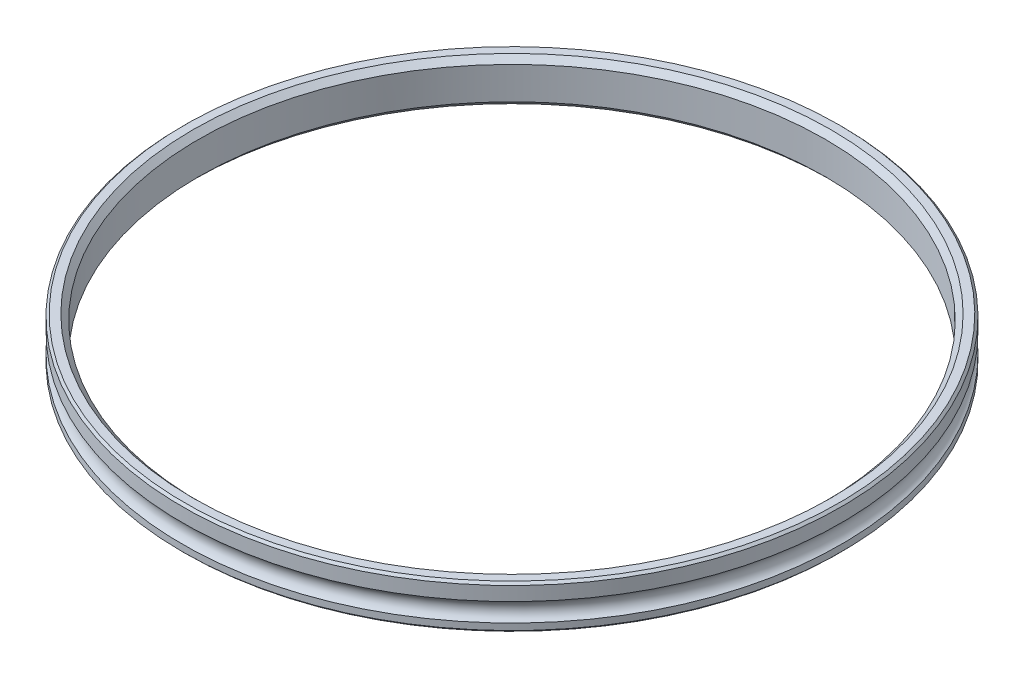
ISO-10303-21;
HEADER;
FILE_DESCRIPTION(('STEP AP214'),'2;1');
FILE_NAME('part.step','',(''),(''),'','','');
FILE_SCHEMA(('AUTOMOTIVE_DESIGN { 1 0 10303 214 1 1 1 1 }'));
ENDSEC;
DATA;
#1=APPLICATION_CONTEXT('core data for automotive mechanical design processes');
#2=APPLICATION_PROTOCOL_DEFINITION('international standard','automotive_design',2000,#1);
#3=PRODUCT_CONTEXT('',#1,'mechanical');
#4=PRODUCT('Part','Part','',(#3));
#5=PRODUCT_RELATED_PRODUCT_CATEGORY('part','',(#4));
#6=PRODUCT_DEFINITION_FORMATION('','',#4);
#7=PRODUCT_DEFINITION_CONTEXT('part definition',#1,'design');
#8=PRODUCT_DEFINITION('design','',#6,#7);
#9=PRODUCT_DEFINITION_SHAPE('','',#8);
#10=(LENGTH_UNIT() NAMED_UNIT(*) SI_UNIT(.MILLI.,.METRE.));
#11=(NAMED_UNIT(*) PLANE_ANGLE_UNIT() SI_UNIT($,.RADIAN.));
#12=(NAMED_UNIT(*) SI_UNIT($,.STERADIAN.) SOLID_ANGLE_UNIT());
#13=UNCERTAINTY_MEASURE_WITH_UNIT(LENGTH_MEASURE(1.E-05),#10,'distance_accuracy_value','');
#14=(GEOMETRIC_REPRESENTATION_CONTEXT(3) GLOBAL_UNCERTAINTY_ASSIGNED_CONTEXT((#13)) GLOBAL_UNIT_ASSIGNED_CONTEXT((#10,
#11,#12)) REPRESENTATION_CONTEXT('',''));
#15=CARTESIAN_POINT('',(0.,0.,0.));
#16=DIRECTION('',(0.,0.,1.));
#17=DIRECTION('',(1.,0.,0.));
#18=AXIS2_PLACEMENT_3D('',#15,#16,#17);
#19=CARTESIAN_POINT('',(0.,0.,0.));
#20=DIRECTION('',(0.,-1.,0.));
#21=DIRECTION('',(0.,0.,-1.));
#22=AXIS2_PLACEMENT_3D('',#19,#20,#21);
#23=CYLINDRICAL_SURFACE('',#22,60.0837);
#24=CARTESIAN_POINT('',(0.,-2.88163000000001,0.));
#25=DIRECTION('',(0.,1.,0.));
#26=DIRECTION('',(0.,0.,1.));
#27=AXIS2_PLACEMENT_3D('',#24,#25,#26);
#28=CIRCLE('',#27,60.0837);
#29=CARTESIAN_POINT('',(0.,-2.88163000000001,60.0837));
#30=VERTEX_POINT('',#29);
#31=EDGE_CURVE('E40',#30,#30,#28,.T.);
#32=ORIENTED_EDGE('',*,*,#31,.T.);
#33=EDGE_LOOP('',(#32));
#34=FACE_BOUND('',#33,.T.);
#35=CARTESIAN_POINT('',(0.,-1.69230490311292,0.));
#36=DIRECTION('',(0.,-1.,0.));
#37=DIRECTION('',(0.,0.,-1.));
#38=AXIS2_PLACEMENT_3D('',#35,#36,#37);
#39=CIRCLE('',#38,60.0837);
#40=CARTESIAN_POINT('',(0.,-1.69230490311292,-60.0837));
#41=VERTEX_POINT('',#40);
#42=EDGE_CURVE('E64',#41,#41,#39,.T.);
#43=ORIENTED_EDGE('',*,*,#42,.T.);
#44=EDGE_LOOP('',(#43));
#45=FACE_BOUND('',#44,.T.);
#46=ADVANCED_FACE('F29',(#34,#45),#23,.T.);
#47=CARTESIAN_POINT('',(0.,4.23036999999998,0.));
#48=DIRECTION('',(0.,-1.,0.));
#49=DIRECTION('',(0.,0.,-1.));
#50=AXIS2_PLACEMENT_3D('',#47,#48,#49);
#51=CIRCLE('',#50,60.0837);
#52=CARTESIAN_POINT('',(0.,4.23036999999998,-60.0837));
#53=VERTEX_POINT('',#52);
#54=EDGE_CURVE('E36',#53,#53,#51,.T.);
#55=ORIENTED_EDGE('',*,*,#54,.T.);
#56=EDGE_LOOP('',(#55));
#57=FACE_BOUND('',#56,.T.);
#58=CARTESIAN_POINT('',(0.,1.69230490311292,0.));
#59=DIRECTION('',(0.,-1.,0.));
#60=DIRECTION('',(0.,0.,-1.));
#61=AXIS2_PLACEMENT_3D('',#58,#59,#60);
#62=CIRCLE('',#61,60.0837);
#63=CARTESIAN_POINT('',(0.,1.69230490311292,-60.0837));
#64=VERTEX_POINT('',#63);
#65=EDGE_CURVE('E61',#64,#64,#62,.T.);
#66=ORIENTED_EDGE('',*,*,#65,.F.);
#67=EDGE_LOOP('',(#66));
#68=FACE_BOUND('',#67,.T.);
#69=ADVANCED_FACE('F86',(#57,#68),#23,.T.);
#70=CARTESIAN_POINT('',(0.,0.,0.));
#71=DIRECTION('',(0.,-1.,0.));
#72=DIRECTION('',(0.,0.,-1.));
#73=AXIS2_PLACEMENT_3D('',#70,#71,#72);
#74=CYLINDRICAL_SURFACE('',#73,57.15);
#75=CARTESIAN_POINT('',(0.,-2.27838000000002,0.));
#76=DIRECTION('',(0.,1.,0.));
#77=DIRECTION('',(0.,0.,1.));
#78=AXIS2_PLACEMENT_3D('',#75,#76,#77);
#79=CIRCLE('',#78,57.15);
#80=CARTESIAN_POINT('',(0.,-2.27838000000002,57.15));
#81=VERTEX_POINT('',#80);
#82=EDGE_CURVE('E55',#81,#81,#79,.F.);
#83=ORIENTED_EDGE('',*,*,#82,.T.);
#84=EDGE_LOOP('',(#83));
#85=FACE_BOUND('',#84,.T.);
#86=CARTESIAN_POINT('',(0.,3.62711999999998,0.));
#87=DIRECTION('',(0.,-1.,0.));
#88=DIRECTION('',(0.,0.,-1.));
#89=AXIS2_PLACEMENT_3D('',#86,#87,#88);
#90=CIRCLE('',#89,57.15);
#91=CARTESIAN_POINT('',(0.,3.62711999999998,-57.15));
#92=VERTEX_POINT('',#91);
#93=EDGE_CURVE('E58',#92,#92,#90,.F.);
#94=ORIENTED_EDGE('',*,*,#93,.T.);
#95=EDGE_LOOP('',(#94));
#96=FACE_BOUND('',#95,.T.);
#97=ADVANCED_FACE('F31',(#85,#96),#74,.F.);
#98=CARTESIAN_POINT('',(-57.15,4.64311999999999,0.));
#99=DIRECTION('',(0.,-1.,0.));
#100=DIRECTION('',(0.,0.,-1.));
#101=AXIS2_PLACEMENT_3D('',#98,#99,#100);
#102=PLANE('',#101);
#103=CARTESIAN_POINT('',(0.,4.64311999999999,0.));
#104=DIRECTION('',(0.,-1.,0.));
#105=DIRECTION('',(0.,0.,-1.));
#106=AXIS2_PLACEMENT_3D('',#103,#104,#105);
#107=CIRCLE('',#106,59.67095);
#108=CARTESIAN_POINT('',(0.,4.64311999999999,-59.67095));
#109=VERTEX_POINT('',#108);
#110=EDGE_CURVE('E10',#109,#109,#107,.F.);
#111=ORIENTED_EDGE('',*,*,#110,.T.);
#112=EDGE_LOOP('',(#111));
#113=FACE_BOUND('',#112,.T.);
#114=CARTESIAN_POINT('',(0.,4.64311999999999,0.));
#115=DIRECTION('',(0.,-1.,0.));
#116=DIRECTION('',(0.,0.,-1.));
#117=AXIS2_PLACEMENT_3D('',#114,#115,#116);
#118=CIRCLE('',#117,58.166);
#119=CARTESIAN_POINT('',(0.,4.64311999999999,-58.166));
#120=VERTEX_POINT('',#119);
#121=EDGE_CURVE('E49',#120,#120,#118,.T.);
#122=ORIENTED_EDGE('',*,*,#121,.T.);
#123=EDGE_LOOP('',(#122));
#124=FACE_BOUND('',#123,.T.);
#125=ADVANCED_FACE('F82',(#113,#124),#102,.F.);
#126=CARTESIAN_POINT('',(-57.15,-3.29438000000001,0.));
#127=DIRECTION('',(0.,1.,0.));
#128=DIRECTION('',(0.,0.,1.));
#129=AXIS2_PLACEMENT_3D('',#126,#127,#128);
#130=PLANE('',#129);
#131=CARTESIAN_POINT('',(0.,-3.29438000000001,0.));
#132=DIRECTION('',(0.,1.,0.));
#133=DIRECTION('',(0.,0.,1.));
#134=AXIS2_PLACEMENT_3D('',#131,#132,#133);
#135=CIRCLE('',#134,59.67095);
#136=CARTESIAN_POINT('',(0.,-3.29438000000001,59.67095));
#137=VERTEX_POINT('',#136);
#138=EDGE_CURVE('E44',#137,#137,#135,.F.);
#139=ORIENTED_EDGE('',*,*,#138,.T.);
#140=EDGE_LOOP('',(#139));
#141=FACE_BOUND('',#140,.T.);
#142=CARTESIAN_POINT('',(0.,-3.29438000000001,0.));
#143=DIRECTION('',(0.,1.,0.));
#144=DIRECTION('',(0.,0.,1.));
#145=AXIS2_PLACEMENT_3D('',#142,#143,#144);
#146=CIRCLE('',#145,58.166);
#147=CARTESIAN_POINT('',(0.,-3.29438000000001,58.166));
#148=VERTEX_POINT('',#147);
#149=EDGE_CURVE('E52',#148,#148,#146,.T.);
#150=ORIENTED_EDGE('',*,*,#149,.T.);
#151=EDGE_LOOP('',(#150));
#152=FACE_BOUND('',#151,.T.);
#153=ADVANCED_FACE('F72',(#141,#152),#130,.F.);
#154=CARTESIAN_POINT('',(0.,0.,0.));
#155=DIRECTION('',(0.,-1.,0.));
#156=DIRECTION('',(0.,0.,-1.));
#157=AXIS2_PLACEMENT_3D('',#154,#155,#156);
#158=TOROIDAL_SURFACE('',#157,61.11875,1.98374000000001);
#159=ORIENTED_EDGE('',*,*,#65,.T.);
#160=EDGE_LOOP('',(#159));
#161=FACE_BOUND('',#160,.T.);
#162=ORIENTED_EDGE('',*,*,#42,.F.);
#163=EDGE_LOOP('',(#162));
#164=FACE_BOUND('',#163,.T.);
#165=ADVANCED_FACE('F69',(#161,#164),#158,.F.);
#166=CARTESIAN_POINT('',(0.,-2.27838000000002,0.));
#167=DIRECTION('',(0.,-1.,0.));
#168=DIRECTION('',(0.,0.,-1.));
#169=AXIS2_PLACEMENT_3D('',#166,#167,#168);
#170=CONICAL_SURFACE('',#169,57.15,0.785398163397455);
#171=ORIENTED_EDGE('',*,*,#149,.F.);
#172=EDGE_LOOP('',(#171));
#173=FACE_BOUND('',#172,.T.);
#174=ORIENTED_EDGE('',*,*,#82,.F.);
#175=EDGE_LOOP('',(#174));
#176=FACE_BOUND('',#175,.T.);
#177=ADVANCED_FACE('F71',(#173,#176),#170,.F.);
#178=CARTESIAN_POINT('',(0.,4.64311999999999,0.));
#179=DIRECTION('',(0.,1.,0.));
#180=DIRECTION('',(0.,0.,1.));
#181=AXIS2_PLACEMENT_3D('',#178,#179,#180);
#182=CONICAL_SURFACE('',#181,58.166,0.785398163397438);
#183=ORIENTED_EDGE('',*,*,#93,.F.);
#184=EDGE_LOOP('',(#183));
#185=FACE_BOUND('',#184,.T.);
#186=ORIENTED_EDGE('',*,*,#121,.F.);
#187=EDGE_LOOP('',(#186));
#188=FACE_BOUND('',#187,.T.);
#189=ADVANCED_FACE('F79',(#185,#188),#182,.F.);
#190=CARTESIAN_POINT('',(0.,-3.29438000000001,0.));
#191=DIRECTION('',(0.,1.,0.));
#192=DIRECTION('',(0.,0.,1.));
#193=AXIS2_PLACEMENT_3D('',#190,#191,#192);
#194=CONICAL_SURFACE('',#193,59.67095,0.785398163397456);
#195=ORIENTED_EDGE('',*,*,#31,.F.);
#196=EDGE_LOOP('',(#195));
#197=FACE_BOUND('',#196,.T.);
#198=ORIENTED_EDGE('',*,*,#138,.F.);
#199=EDGE_LOOP('',(#198));
#200=FACE_BOUND('',#199,.T.);
#201=ADVANCED_FACE('F101',(#197,#200),#194,.T.);
#202=CARTESIAN_POINT('',(0.,4.23036999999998,0.));
#203=DIRECTION('',(0.,-1.,0.));
#204=DIRECTION('',(0.,0.,-1.));
#205=AXIS2_PLACEMENT_3D('',#202,#203,#204);
#206=CONICAL_SURFACE('',#205,60.0837,0.78539816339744);
#207=ORIENTED_EDGE('',*,*,#110,.F.);
#208=EDGE_LOOP('',(#207));
#209=FACE_BOUND('',#208,.T.);
#210=ORIENTED_EDGE('',*,*,#54,.F.);
#211=EDGE_LOOP('',(#210));
#212=FACE_BOUND('',#211,.T.);
#213=ADVANCED_FACE('F107',(#209,#212),#206,.T.);
#214=CLOSED_SHELL('',(#46,#69,#97,#125,#153,#165,#177,#189,#201,#213));
#215=MANIFOLD_SOLID_BREP('B2',#214);
#216=ADVANCED_BREP_SHAPE_REPRESENTATION('',(#18,#215),#14);
#217=SHAPE_DEFINITION_REPRESENTATION(#9,#216);
ENDSEC;
END-ISO-10303-21;
